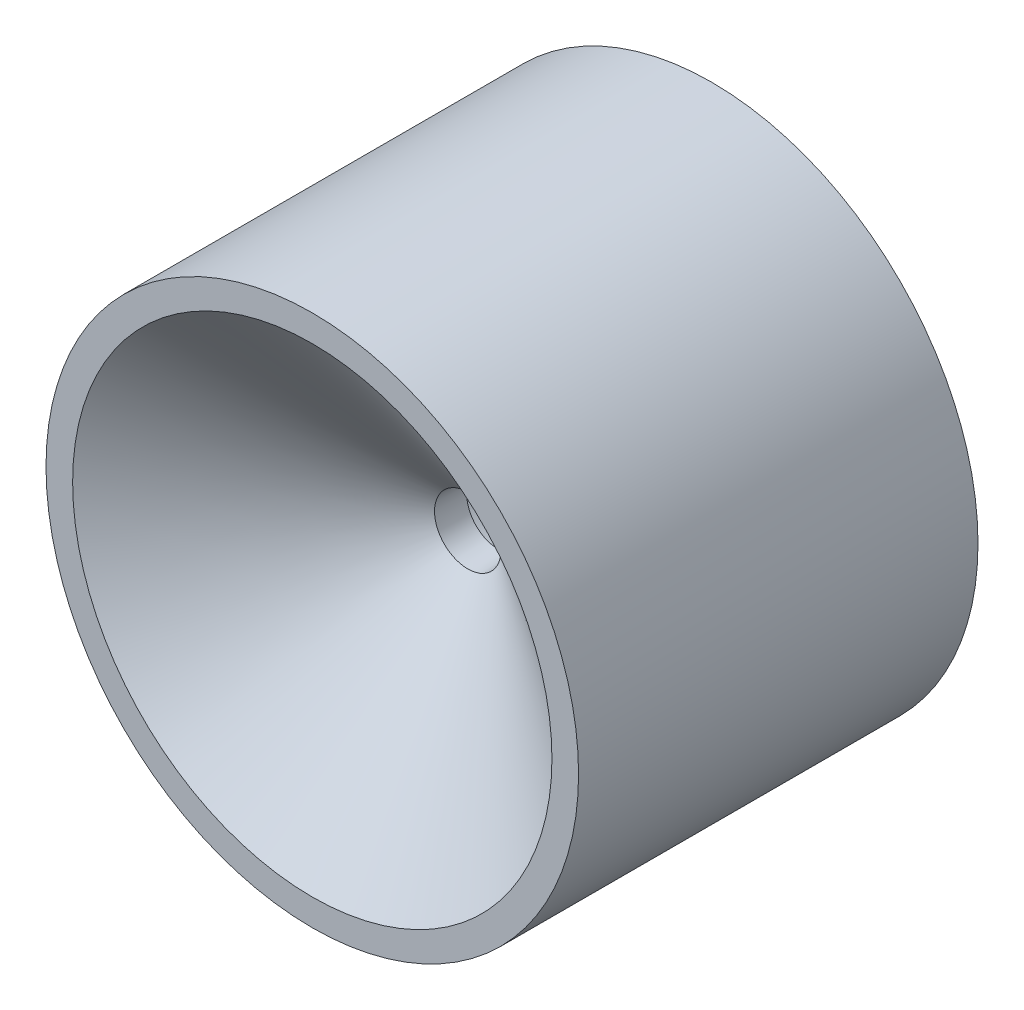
from build123d import *

# Parameters (mm, degrees)
ESQUISSE1_R             = 10
BOSS_EXTRU_1_DEPTH      = 15
ESQUISSE2_R             = 3.4
ENL_V_MAT_EXTRU_1_DEPTH = 8
ESQUISSE3_R             = 1.2
ENL_V_MAT_EXTRU_2_DEPTH = 17.248076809
ENL_V_MAT_EXTRU_2_DRAFT = 2.45
ESQUISSE5_R             = 9
ENL_V_MAT_EXTRU_3_DEPTH = 6
ENL_V_MAT_EXTRU_3_DRAFT = -53
ESQUISSE6_R             = 9
ESQUISSE6_R_2           = 5.5
ENL_V_MAT_EXTRU_4_DEPTH = 11.5


with BuildPart() as part:
    # Esquisse1 → Boss.-Extru.1 (new body)
    with BuildSketch(Plane.XY):
        Circle(ESQUISSE1_R)
    extrude(amount=BOSS_EXTRU_1_DEPTH)

    # Esquisse2 → Enl_v. mat.-Extru.1 (cut)
    with BuildSketch(Plane.XY):
        Circle(ESQUISSE2_R)
    extrude(amount=ENL_V_MAT_EXTRU_1_DEPTH, mode=Mode.SUBTRACT)


with BuildPart() as enl_v_mat_extru_2_tool:
    # Esquisse3 → Enl_v. mat.-Extru.2 (with draft: the straight prism first)
    with BuildSketch(Plane(origin=(0, 0, 8), x_dir=(-1, 0, 0), z_dir=(0, 0, -1))):
        Circle(ESQUISSE3_R)
    extrude(amount=-ENL_V_MAT_EXTRU_2_DEPTH)
    # Enl_v. mat.-Extru.2: the draft: its side faces are tilted about the plane it starts from
    enl_v_mat_extru_2_sides = [enl_v_mat_extru_2_tool.faces().sort_by_distance(p)[0] for p in [
        (1.2, 0, 16.624038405),
    ]]
    draft(enl_v_mat_extru_2_sides, Plane(origin=(0, 0, 8), x_dir=(-1, 0, 0), z_dir=(0, 0, -1)), ENL_V_MAT_EXTRU_2_DRAFT)


with BuildPart() as part_1:
    add(part.part)

    # Enl_v. mat.-Extru.2: cut by enl_v_mat_extru_2_tool
    add(enl_v_mat_extru_2_tool.part, mode=Mode.SUBTRACT)


with BuildPart() as enl_v_mat_extru_3_tool:
    # Esquisse5 → Enl_v. mat.-Extru.3 (with draft: the straight prism first)
    with BuildSketch(Plane.XY.offset(15)):
        Circle(ESQUISSE5_R)
    extrude(amount=-ENL_V_MAT_EXTRU_3_DEPTH)
    # Enl_v. mat.-Extru.3: the draft: its side faces are tilted about the plane it starts from
    enl_v_mat_extru_3_sides = [enl_v_mat_extru_3_tool.faces().sort_by_distance(p)[0] for p in [
        (-9, 0, 12),
    ]]
    draft(enl_v_mat_extru_3_sides, Plane.XY.offset(15), ENL_V_MAT_EXTRU_3_DRAFT)


with BuildPart() as part_2:
    add(part_1.part)

    # Enl_v. mat.-Extru.3: cut by enl_v_mat_extru_3_tool
    add(enl_v_mat_extru_3_tool.part, mode=Mode.SUBTRACT)

    # Esquisse6 → Enl_v. mat.-Extru.4 (cut)
    with BuildSketch(Plane(origin=(0, 0, 0), x_dir=(-1, 0, 0), z_dir=(0, 0, -1))):
        Circle(ESQUISSE6_R)
        Circle(ESQUISSE6_R_2, mode=Mode.SUBTRACT)
    extrude(amount=-ENL_V_MAT_EXTRU_4_DEPTH, mode=Mode.SUBTRACT)


solid = part_2.part
